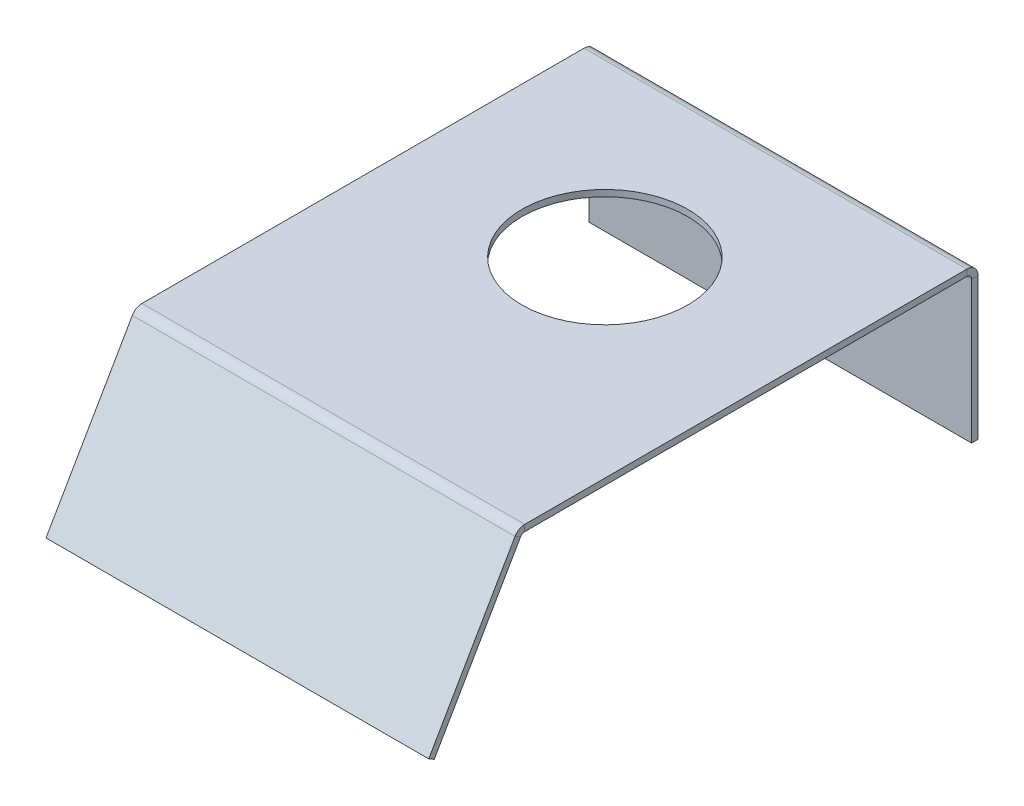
ISO-10303-21;
HEADER;
FILE_DESCRIPTION(('STEP AP214'),'2;1');
FILE_NAME('part.step','',(''),(''),'','','');
FILE_SCHEMA(('AUTOMOTIVE_DESIGN { 1 0 10303 214 1 1 1 1 }'));
ENDSEC;
DATA;
#1=APPLICATION_CONTEXT('core data for automotive mechanical design processes');
#2=APPLICATION_PROTOCOL_DEFINITION('international standard','automotive_design',2000,#1);
#3=PRODUCT_CONTEXT('',#1,'mechanical');
#4=PRODUCT('Part','Part','',(#3));
#5=PRODUCT_RELATED_PRODUCT_CATEGORY('part','',(#4));
#6=PRODUCT_DEFINITION_FORMATION('','',#4);
#7=PRODUCT_DEFINITION_CONTEXT('part definition',#1,'design');
#8=PRODUCT_DEFINITION('design','',#6,#7);
#9=PRODUCT_DEFINITION_SHAPE('','',#8);
#10=(LENGTH_UNIT() NAMED_UNIT(*) SI_UNIT(.MILLI.,.METRE.));
#11=(NAMED_UNIT(*) PLANE_ANGLE_UNIT() SI_UNIT($,.RADIAN.));
#12=(NAMED_UNIT(*) SI_UNIT($,.STERADIAN.) SOLID_ANGLE_UNIT());
#13=UNCERTAINTY_MEASURE_WITH_UNIT(LENGTH_MEASURE(1.E-05),#10,'distance_accuracy_value','');
#14=(GEOMETRIC_REPRESENTATION_CONTEXT(3) GLOBAL_UNCERTAINTY_ASSIGNED_CONTEXT((#13)) GLOBAL_UNIT_ASSIGNED_CONTEXT((#10,
#11,#12)) REPRESENTATION_CONTEXT('',''));
#15=CARTESIAN_POINT('',(0.,0.,0.));
#16=DIRECTION('',(0.,0.,1.));
#17=DIRECTION('',(1.,0.,0.));
#18=AXIS2_PLACEMENT_3D('',#15,#16,#17);
#19=CARTESIAN_POINT('',(60.,0.,-53.5));
#20=DIRECTION('',(1.,0.,0.));
#21=DIRECTION('',(0.,0.,-1.));
#22=AXIS2_PLACEMENT_3D('',#19,#20,#21);
#23=PLANE('',#22);
#24=DIRECTION('',(0.,1.,0.));
#25=VECTOR('',#24,1.);
#26=CARTESIAN_POINT('',(60.,0.,-53.5));
#27=LINE('',#26,#25);
#28=CARTESIAN_POINT('',(60.,0.,-53.5));
#29=VERTEX_POINT('',#28);
#30=CARTESIAN_POINT('',(60.,2.,-53.5));
#31=VERTEX_POINT('',#30);
#32=EDGE_CURVE('E11',#29,#31,#27,.T.);
#33=ORIENTED_EDGE('',*,*,#32,.F.);
#34=CARTESIAN_POINT('',(60.,-1.5,-53.5));
#35=DIRECTION('',(-1.,0.,0.));
#36=DIRECTION('',(0.,0.,1.));
#37=AXIS2_PLACEMENT_3D('',#34,#35,#36);
#38=CIRCLE('',#37,1.5);
#39=CARTESIAN_POINT('',(60.,-1.5,-55.));
#40=VERTEX_POINT('',#39);
#41=EDGE_CURVE('E245',#40,#29,#38,.F.);
#42=ORIENTED_EDGE('',*,*,#41,.F.);
#43=DIRECTION('',(0.,0.,1.));
#44=VECTOR('',#43,1.);
#45=CARTESIAN_POINT('',(60.,-1.5,-57.));
#46=LINE('',#45,#44);
#47=CARTESIAN_POINT('',(60.,-1.5,-57.));
#48=VERTEX_POINT('',#47);
#49=EDGE_CURVE('E42',#48,#40,#46,.T.);
#50=ORIENTED_EDGE('',*,*,#49,.F.);
#51=CARTESIAN_POINT('',(60.,-1.5,-53.5));
#52=DIRECTION('',(1.,0.,0.));
#53=DIRECTION('',(0.,0.,-1.));
#54=AXIS2_PLACEMENT_3D('',#51,#52,#53);
#55=CIRCLE('',#54,3.5);
#56=EDGE_CURVE('E142',#48,#31,#55,.T.);
#57=ORIENTED_EDGE('',*,*,#56,.T.);
#58=EDGE_LOOP('',(#33,#42,#50,#57));
#59=FACE_BOUND('',#58,.T.);
#60=ADVANCED_FACE('F34',(#59),#23,.T.);
#61=CARTESIAN_POINT('',(60.,-1.5,-57.));
#62=DIRECTION('',(1.,0.,0.));
#63=DIRECTION('',(0.,0.,-1.));
#64=AXIS2_PLACEMENT_3D('',#61,#62,#63);
#65=PLANE('',#64);
#66=DIRECTION('',(0.,0.,1.));
#67=VECTOR('',#66,1.);
#68=CARTESIAN_POINT('',(60.,0.,0.));
#69=LINE('',#68,#67);
#70=CARTESIAN_POINT('',(60.,0.,85.1339745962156));
#71=VERTEX_POINT('',#70);
#72=EDGE_CURVE('E137',#29,#71,#69,.T.);
#73=ORIENTED_EDGE('',*,*,#72,.F.);
#74=ORIENTED_EDGE('',*,*,#32,.T.);
#75=DIRECTION('',(0.,0.,1.));
#76=VECTOR('',#75,1.);
#77=CARTESIAN_POINT('',(60.,2.,-55.));
#78=LINE('',#77,#76);
#79=CARTESIAN_POINT('',(60.,1.99999999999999,85.1339745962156));
#80=VERTEX_POINT('',#79);
#81=EDGE_CURVE('E134',#31,#80,#78,.T.);
#82=ORIENTED_EDGE('',*,*,#81,.T.);
#83=DIRECTION('',(0.,-1.,0.));
#84=VECTOR('',#83,1.);
#85=CARTESIAN_POINT('',(60.,1.99999999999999,85.1339745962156));
#86=LINE('',#85,#84);
#87=EDGE_CURVE('E225',#80,#71,#86,.T.);
#88=ORIENTED_EDGE('',*,*,#87,.T.);
#89=EDGE_LOOP('',(#73,#74,#82,#88));
#90=FACE_BOUND('',#89,.T.);
#91=ADVANCED_FACE('F132',(#90),#65,.T.);
#92=CARTESIAN_POINT('',(-60.,-1.5,-55.));
#93=DIRECTION('',(-1.,0.,0.));
#94=DIRECTION('',(0.,0.,1.));
#95=AXIS2_PLACEMENT_3D('',#92,#93,#94);
#96=PLANE('',#95);
#97=DIRECTION('',(0.,0.,-1.));
#98=VECTOR('',#97,1.);
#99=CARTESIAN_POINT('',(-60.,-1.5,-55.));
#100=LINE('',#99,#98);
#101=CARTESIAN_POINT('',(-60.,-1.5,-55.));
#102=VERTEX_POINT('',#101);
#103=CARTESIAN_POINT('',(-60.,-1.5,-57.));
#104=VERTEX_POINT('',#103);
#105=EDGE_CURVE('E230',#102,#104,#100,.T.);
#106=ORIENTED_EDGE('',*,*,#105,.F.);
#107=CARTESIAN_POINT('',(-60.,-1.5,-53.5));
#108=DIRECTION('',(-1.,0.,0.));
#109=DIRECTION('',(0.,0.,1.));
#110=AXIS2_PLACEMENT_3D('',#107,#108,#109);
#111=CIRCLE('',#110,1.5);
#112=CARTESIAN_POINT('',(-60.,0.,-53.5));
#113=VERTEX_POINT('',#112);
#114=EDGE_CURVE('E182',#102,#113,#111,.F.);
#115=ORIENTED_EDGE('',*,*,#114,.T.);
#116=DIRECTION('',(0.,-1.,0.));
#117=VECTOR('',#116,1.);
#118=CARTESIAN_POINT('',(-60.,2.,-53.5));
#119=LINE('',#118,#117);
#120=CARTESIAN_POINT('',(-60.,2.,-53.5));
#121=VERTEX_POINT('',#120);
#122=EDGE_CURVE('E228',#121,#113,#119,.T.);
#123=ORIENTED_EDGE('',*,*,#122,.F.);
#124=CARTESIAN_POINT('',(-60.,-1.5,-53.5));
#125=DIRECTION('',(1.,0.,0.));
#126=DIRECTION('',(0.,0.,-1.));
#127=AXIS2_PLACEMENT_3D('',#124,#125,#126);
#128=CIRCLE('',#127,3.5);
#129=EDGE_CURVE('E154',#104,#121,#128,.T.);
#130=ORIENTED_EDGE('',*,*,#129,.F.);
#131=EDGE_LOOP('',(#106,#115,#123,#130));
#132=FACE_BOUND('',#131,.T.);
#133=ADVANCED_FACE('F288',(#132),#96,.T.);
#134=CARTESIAN_POINT('',(-60.,2.,-53.5));
#135=DIRECTION('',(-1.,0.,0.));
#136=DIRECTION('',(0.,0.,1.));
#137=AXIS2_PLACEMENT_3D('',#134,#135,#136);
#138=PLANE('',#137);
#139=DIRECTION('',(0.,1.,0.));
#140=VECTOR('',#139,1.);
#141=CARTESIAN_POINT('',(-60.,-46.,-55.));
#142=LINE('',#141,#140);
#143=CARTESIAN_POINT('',(-60.,-46.,-55.));
#144=VERTEX_POINT('',#143);
#145=EDGE_CURVE('E185',#144,#102,#142,.T.);
#146=ORIENTED_EDGE('',*,*,#145,.T.);
#147=ORIENTED_EDGE('',*,*,#105,.T.);
#148=DIRECTION('',(0.,1.,0.));
#149=VECTOR('',#148,1.);
#150=CARTESIAN_POINT('',(-60.,-46.,-57.));
#151=LINE('',#150,#149);
#152=CARTESIAN_POINT('',(-60.,-46.,-57.));
#153=VERTEX_POINT('',#152);
#154=EDGE_CURVE('E191',#153,#104,#151,.T.);
#155=ORIENTED_EDGE('',*,*,#154,.F.);
#156=DIRECTION('',(0.,0.,1.));
#157=VECTOR('',#156,1.);
#158=CARTESIAN_POINT('',(-60.,-46.,-57.));
#159=LINE('',#158,#157);
#160=EDGE_CURVE('E188',#153,#144,#159,.T.);
#161=ORIENTED_EDGE('',*,*,#160,.T.);
#162=EDGE_LOOP('',(#146,#147,#155,#161));
#163=FACE_BOUND('',#162,.T.);
#164=ADVANCED_FACE('F292',(#163),#138,.T.);
#165=CARTESIAN_POINT('',(60.,-0.750000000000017,86.4330127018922));
#166=DIRECTION('',(1.,0.,0.));
#167=DIRECTION('',(0.,0.,-1.));
#168=AXIS2_PLACEMENT_3D('',#165,#166,#167);
#169=PLANE('',#168);
#170=DIRECTION('',(0.,0.499999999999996,0.866025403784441));
#171=VECTOR('',#170,1.);
#172=CARTESIAN_POINT('',(60.,-0.750000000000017,86.4330127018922));
#173=LINE('',#172,#171);
#174=CARTESIAN_POINT('',(60.,-0.750000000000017,86.4330127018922));
#175=VERTEX_POINT('',#174);
#176=CARTESIAN_POINT('',(60.,0.249999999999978,88.1650635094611));
#177=VERTEX_POINT('',#176);
#178=EDGE_CURVE('E50',#175,#177,#173,.T.);
#179=ORIENTED_EDGE('',*,*,#178,.F.);
#180=CARTESIAN_POINT('',(60.,-1.50000000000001,85.1339745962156));
#181=DIRECTION('',(-1.,0.,0.));
#182=DIRECTION('',(0.,0.,1.));
#183=AXIS2_PLACEMENT_3D('',#180,#181,#182);
#184=CIRCLE('',#183,1.5);
#185=EDGE_CURVE('E255',#71,#175,#184,.F.);
#186=ORIENTED_EDGE('',*,*,#185,.F.);
#187=ORIENTED_EDGE('',*,*,#87,.F.);
#188=CARTESIAN_POINT('',(60.,-1.50000000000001,85.1339745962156));
#189=DIRECTION('',(1.,0.,0.));
#190=DIRECTION('',(0.,0.,-1.));
#191=AXIS2_PLACEMENT_3D('',#188,#189,#190);
#192=CIRCLE('',#191,3.5);
#193=EDGE_CURVE('E162',#80,#177,#192,.T.);
#194=ORIENTED_EDGE('',*,*,#193,.T.);
#195=EDGE_LOOP('',(#179,#186,#187,#194));
#196=FACE_BOUND('',#195,.T.);
#197=ADVANCED_FACE('F298',(#196),#169,.T.);
#198=CARTESIAN_POINT('',(60.,1.99999999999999,85.1339745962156));
#199=DIRECTION('',(1.,0.,0.));
#200=DIRECTION('',(0.,0.,-1.));
#201=AXIS2_PLACEMENT_3D('',#198,#199,#200);
#202=PLANE('',#201);
#203=DIRECTION('',(0.,-0.86602540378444,0.499999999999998));
#204=VECTOR('',#203,1.);
#205=CARTESIAN_POINT('',(60.,0.,86.));
#206=LINE('',#205,#204);
#207=CARTESIAN_POINT('',(60.,-47.6313972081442,113.5));
#208=VERTEX_POINT('',#207);
#209=EDGE_CURVE('E258',#175,#208,#206,.T.);
#210=ORIENTED_EDGE('',*,*,#209,.F.);
#211=ORIENTED_EDGE('',*,*,#178,.T.);
#212=DIRECTION('',(0.,-0.86602540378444,0.499999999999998));
#213=VECTOR('',#212,1.);
#214=CARTESIAN_POINT('',(60.,0.999999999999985,87.7320508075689));
#215=LINE('',#214,#213);
#216=CARTESIAN_POINT('',(60.,-46.6313972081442,115.232050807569));
#217=VERTEX_POINT('',#216);
#218=EDGE_CURVE('E104',#177,#217,#215,.T.);
#219=ORIENTED_EDGE('',*,*,#218,.T.);
#220=DIRECTION('',(0.,0.499999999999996,0.866025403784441));
#221=VECTOR('',#220,1.);
#222=CARTESIAN_POINT('',(60.,-47.6313972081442,113.5));
#223=LINE('',#222,#221);
#224=EDGE_CURVE('E261',#208,#217,#223,.T.);
#225=ORIENTED_EDGE('',*,*,#224,.F.);
#226=EDGE_LOOP('',(#210,#211,#219,#225));
#227=FACE_BOUND('',#226,.T.);
#228=ADVANCED_FACE('F302',(#227),#202,.T.);
#229=CARTESIAN_POINT('',(-60.,0.,85.1339745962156));
#230=DIRECTION('',(-1.,0.,0.));
#231=DIRECTION('',(0.,0.,1.));
#232=AXIS2_PLACEMENT_3D('',#229,#230,#231);
#233=PLANE('',#232);
#234=DIRECTION('',(0.,1.,0.));
#235=VECTOR('',#234,1.);
#236=CARTESIAN_POINT('',(-60.,0.,85.1339745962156));
#237=LINE('',#236,#235);
#238=CARTESIAN_POINT('',(-60.,0.,85.1339745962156));
#239=VERTEX_POINT('',#238);
#240=CARTESIAN_POINT('',(-60.,1.99999999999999,85.1339745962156));
#241=VERTEX_POINT('',#240);
#242=EDGE_CURVE('E91',#239,#241,#237,.T.);
#243=ORIENTED_EDGE('',*,*,#242,.F.);
#244=CARTESIAN_POINT('',(-60.,-1.50000000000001,85.1339745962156));
#245=DIRECTION('',(-1.,0.,0.));
#246=DIRECTION('',(0.,0.,1.));
#247=AXIS2_PLACEMENT_3D('',#244,#245,#246);
#248=CIRCLE('',#247,1.5);
#249=CARTESIAN_POINT('',(-60.,-0.750000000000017,86.4330127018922));
#250=VERTEX_POINT('',#249);
#251=EDGE_CURVE('E178',#239,#250,#248,.F.);
#252=ORIENTED_EDGE('',*,*,#251,.T.);
#253=DIRECTION('',(0.,-0.499999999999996,-0.866025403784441));
#254=VECTOR('',#253,1.);
#255=CARTESIAN_POINT('',(-60.,0.249999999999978,88.1650635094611));
#256=LINE('',#255,#254);
#257=CARTESIAN_POINT('',(-60.,0.249999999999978,88.1650635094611));
#258=VERTEX_POINT('',#257);
#259=EDGE_CURVE('E98',#258,#250,#256,.T.);
#260=ORIENTED_EDGE('',*,*,#259,.F.);
#261=CARTESIAN_POINT('',(-60.,-1.50000000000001,85.1339745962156));
#262=DIRECTION('',(1.,0.,0.));
#263=DIRECTION('',(0.,0.,-1.));
#264=AXIS2_PLACEMENT_3D('',#261,#262,#263);
#265=CIRCLE('',#264,3.5);
#266=EDGE_CURVE('E197',#241,#258,#265,.T.);
#267=ORIENTED_EDGE('',*,*,#266,.F.);
#268=EDGE_LOOP('',(#243,#252,#260,#267));
#269=FACE_BOUND('',#268,.T.);
#270=ADVANCED_FACE('F306',(#269),#233,.T.);
#271=CARTESIAN_POINT('',(-60.,0.249999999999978,88.1650635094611));
#272=DIRECTION('',(-1.,0.,0.));
#273=DIRECTION('',(0.,0.,1.));
#274=AXIS2_PLACEMENT_3D('',#271,#272,#273);
#275=PLANE('',#274);
#276=DIRECTION('',(0.,0.,1.));
#277=VECTOR('',#276,1.);
#278=CARTESIAN_POINT('',(-60.,0.,-55.));
#279=LINE('',#278,#277);
#280=EDGE_CURVE('E180',#113,#239,#279,.T.);
#281=ORIENTED_EDGE('',*,*,#280,.T.);
#282=ORIENTED_EDGE('',*,*,#242,.T.);
#283=DIRECTION('',(0.,0.,1.));
#284=VECTOR('',#283,1.);
#285=CARTESIAN_POINT('',(-60.,2.,0.));
#286=LINE('',#285,#284);
#287=EDGE_CURVE('E195',#121,#241,#286,.T.);
#288=ORIENTED_EDGE('',*,*,#287,.F.);
#289=ORIENTED_EDGE('',*,*,#122,.T.);
#290=EDGE_LOOP('',(#281,#282,#288,#289));
#291=FACE_BOUND('',#290,.T.);
#292=ADVANCED_FACE('F309',(#291),#275,.T.);
#293=CARTESIAN_POINT('',(60.,0.999999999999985,87.7320508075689));
#294=DIRECTION('',(0.,-0.499999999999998,-0.86602540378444));
#295=DIRECTION('',(0.,0.86602540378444,-0.499999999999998));
#296=AXIS2_PLACEMENT_3D('',#293,#294,#295);
#297=PLANE('',#296);
#298=DIRECTION('',(0.,-0.86602540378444,0.499999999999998));
#299=VECTOR('',#298,1.);
#300=CARTESIAN_POINT('',(-60.,0.999999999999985,87.7320508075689));
#301=LINE('',#300,#299);
#302=CARTESIAN_POINT('',(-60.,-46.6313972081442,115.232050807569));
#303=VERTEX_POINT('',#302);
#304=EDGE_CURVE('E168',#258,#303,#301,.T.);
#305=ORIENTED_EDGE('',*,*,#304,.T.);
#306=DIRECTION('',(-1.,0.,0.));
#307=VECTOR('',#306,1.);
#308=CARTESIAN_POINT('',(60.,-46.6313972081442,115.232050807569));
#309=LINE('',#308,#307);
#310=EDGE_CURVE('E221',#217,#303,#309,.T.);
#311=ORIENTED_EDGE('',*,*,#310,.F.);
#312=ORIENTED_EDGE('',*,*,#218,.F.);
#313=DIRECTION('',(-1.,0.,0.));
#314=VECTOR('',#313,1.);
#315=CARTESIAN_POINT('',(60.,0.249999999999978,88.1650635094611));
#316=LINE('',#315,#314);
#317=EDGE_CURVE('E164',#177,#258,#316,.T.);
#318=ORIENTED_EDGE('',*,*,#317,.T.);
#319=EDGE_LOOP('',(#305,#311,#312,#318));
#320=FACE_BOUND('',#319,.T.);
#321=ADVANCED_FACE('F312',(#320),#297,.F.);
#322=CARTESIAN_POINT('',(60.,-47.6313972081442,113.5));
#323=DIRECTION('',(0.,-0.866025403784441,0.499999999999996));
#324=DIRECTION('',(0.,-0.499999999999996,-0.866025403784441));
#325=AXIS2_PLACEMENT_3D('',#322,#323,#324);
#326=PLANE('',#325);
#327=DIRECTION('',(0.,0.499999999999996,0.866025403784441));
#328=VECTOR('',#327,1.);
#329=CARTESIAN_POINT('',(-60.,-47.6313972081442,113.5));
#330=LINE('',#329,#328);
#331=CARTESIAN_POINT('',(-60.,-47.6313972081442,113.5));
#332=VERTEX_POINT('',#331);
#333=EDGE_CURVE('E171',#332,#303,#330,.T.);
#334=ORIENTED_EDGE('',*,*,#333,.F.);
#335=DIRECTION('',(-1.,0.,0.));
#336=VECTOR('',#335,1.);
#337=CARTESIAN_POINT('',(60.,-47.6313972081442,113.5));
#338=LINE('',#337,#336);
#339=EDGE_CURVE('E219',#208,#332,#338,.T.);
#340=ORIENTED_EDGE('',*,*,#339,.F.);
#341=ORIENTED_EDGE('',*,*,#224,.T.);
#342=ORIENTED_EDGE('',*,*,#310,.T.);
#343=EDGE_LOOP('',(#334,#340,#341,#342));
#344=FACE_BOUND('',#343,.T.);
#345=ADVANCED_FACE('F315',(#344),#326,.T.);
#346=CARTESIAN_POINT('',(60.,0.,86.));
#347=DIRECTION('',(0.,-0.499999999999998,-0.86602540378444));
#348=DIRECTION('',(0.,0.86602540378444,-0.499999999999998));
#349=AXIS2_PLACEMENT_3D('',#346,#347,#348);
#350=PLANE('',#349);
#351=DIRECTION('',(0.,-0.86602540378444,0.499999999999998));
#352=VECTOR('',#351,1.);
#353=CARTESIAN_POINT('',(-60.,0.,86.));
#354=LINE('',#353,#352);
#355=EDGE_CURVE('E175',#250,#332,#354,.T.);
#356=ORIENTED_EDGE('',*,*,#355,.F.);
#357=DIRECTION('',(-1.,0.,0.));
#358=VECTOR('',#357,1.);
#359=CARTESIAN_POINT('',(60.,-0.750000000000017,86.4330127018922));
#360=LINE('',#359,#358);
#361=EDGE_CURVE('E216',#175,#250,#360,.T.);
#362=ORIENTED_EDGE('',*,*,#361,.F.);
#363=ORIENTED_EDGE('',*,*,#209,.T.);
#364=ORIENTED_EDGE('',*,*,#339,.T.);
#365=EDGE_LOOP('',(#356,#362,#363,#364));
#366=FACE_BOUND('',#365,.T.);
#367=ADVANCED_FACE('F319',(#366),#350,.T.);
#368=CARTESIAN_POINT('',(60.,-1.50000000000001,85.1339745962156));
#369=DIRECTION('',(-1.,0.,0.));
#370=DIRECTION('',(0.,0.,1.));
#371=AXIS2_PLACEMENT_3D('',#368,#369,#370);
#372=CYLINDRICAL_SURFACE('',#371,1.5);
#373=ORIENTED_EDGE('',*,*,#251,.F.);
#374=DIRECTION('',(-1.,0.,0.));
#375=VECTOR('',#374,1.);
#376=CARTESIAN_POINT('',(60.,0.,85.1339745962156));
#377=LINE('',#376,#375);
#378=EDGE_CURVE('E213',#71,#239,#377,.T.);
#379=ORIENTED_EDGE('',*,*,#378,.F.);
#380=ORIENTED_EDGE('',*,*,#185,.T.);
#381=ORIENTED_EDGE('',*,*,#361,.T.);
#382=EDGE_LOOP('',(#373,#379,#380,#381));
#383=FACE_BOUND('',#382,.T.);
#384=ADVANCED_FACE('F323',(#383),#372,.F.);
#385=CARTESIAN_POINT('',(60.,0.,-55.));
#386=DIRECTION('',(0.,-1.,0.));
#387=DIRECTION('',(0.,0.,-1.));
#388=AXIS2_PLACEMENT_3D('',#385,#386,#387);
#389=PLANE('',#388);
#390=CARTESIAN_POINT('',(0.,0.,0.));
#391=DIRECTION('',(0.,-1.,0.));
#392=DIRECTION('',(0.,0.,-1.));
#393=AXIS2_PLACEMENT_3D('',#390,#391,#392);
#394=CIRCLE('',#393,26.);
#395=CARTESIAN_POINT('',(0.,0.,-26.));
#396=VERTEX_POINT('',#395);
#397=EDGE_CURVE('E172',#396,#396,#394,.T.);
#398=ORIENTED_EDGE('',*,*,#397,.F.);
#399=EDGE_LOOP('',(#398));
#400=FACE_BOUND('',#399,.T.);
#401=ORIENTED_EDGE('',*,*,#280,.F.);
#402=DIRECTION('',(-1.,0.,0.));
#403=VECTOR('',#402,1.);
#404=CARTESIAN_POINT('',(60.,0.,-53.5));
#405=LINE('',#404,#403);
#406=EDGE_CURVE('E210',#29,#113,#405,.T.);
#407=ORIENTED_EDGE('',*,*,#406,.F.);
#408=ORIENTED_EDGE('',*,*,#72,.T.);
#409=ORIENTED_EDGE('',*,*,#378,.T.);
#410=EDGE_LOOP('',(#401,#407,#408,#409));
#411=FACE_BOUND('',#410,.T.);
#412=ADVANCED_FACE('F327',(#400,#411),#389,.T.);
#413=CARTESIAN_POINT('',(60.,-1.5,-53.5));
#414=DIRECTION('',(-1.,0.,0.));
#415=DIRECTION('',(0.,0.,1.));
#416=AXIS2_PLACEMENT_3D('',#413,#414,#415);
#417=CYLINDRICAL_SURFACE('',#416,1.5);
#418=ORIENTED_EDGE('',*,*,#114,.F.);
#419=DIRECTION('',(-1.,0.,0.));
#420=VECTOR('',#419,1.);
#421=CARTESIAN_POINT('',(60.,-1.5,-55.));
#422=LINE('',#421,#420);
#423=EDGE_CURVE('E207',#40,#102,#422,.T.);
#424=ORIENTED_EDGE('',*,*,#423,.F.);
#425=ORIENTED_EDGE('',*,*,#41,.T.);
#426=ORIENTED_EDGE('',*,*,#406,.T.);
#427=EDGE_LOOP('',(#418,#424,#425,#426));
#428=FACE_BOUND('',#427,.T.);
#429=ADVANCED_FACE('F244',(#428),#417,.F.);
#430=CARTESIAN_POINT('',(60.,-46.,-55.));
#431=DIRECTION('',(0.,0.,1.));
#432=DIRECTION('',(1.,0.,0.));
#433=AXIS2_PLACEMENT_3D('',#430,#431,#432);
#434=PLANE('',#433);
#435=ORIENTED_EDGE('',*,*,#145,.F.);
#436=DIRECTION('',(-1.,0.,0.));
#437=VECTOR('',#436,1.);
#438=CARTESIAN_POINT('',(60.,-46.,-55.));
#439=LINE('',#438,#437);
#440=CARTESIAN_POINT('',(60.,-46.,-55.));
#441=VERTEX_POINT('',#440);
#442=EDGE_CURVE('E205',#441,#144,#439,.T.);
#443=ORIENTED_EDGE('',*,*,#442,.F.);
#444=DIRECTION('',(0.,1.,0.));
#445=VECTOR('',#444,1.);
#446=CARTESIAN_POINT('',(60.,-46.,-55.));
#447=LINE('',#446,#445);
#448=EDGE_CURVE('E237',#441,#40,#447,.T.);
#449=ORIENTED_EDGE('',*,*,#448,.T.);
#450=ORIENTED_EDGE('',*,*,#423,.T.);
#451=EDGE_LOOP('',(#435,#443,#449,#450));
#452=FACE_BOUND('',#451,.T.);
#453=ADVANCED_FACE('F249',(#452),#434,.T.);
#454=CARTESIAN_POINT('',(60.,-46.,-57.));
#455=DIRECTION('',(0.,-1.,0.));
#456=DIRECTION('',(0.,0.,-1.));
#457=AXIS2_PLACEMENT_3D('',#454,#455,#456);
#458=PLANE('',#457);
#459=ORIENTED_EDGE('',*,*,#160,.F.);
#460=DIRECTION('',(-1.,0.,0.));
#461=VECTOR('',#460,1.);
#462=CARTESIAN_POINT('',(60.,-46.,-57.));
#463=LINE('',#462,#461);
#464=CARTESIAN_POINT('',(60.,-46.,-57.));
#465=VERTEX_POINT('',#464);
#466=EDGE_CURVE('E203',#465,#153,#463,.T.);
#467=ORIENTED_EDGE('',*,*,#466,.F.);
#468=DIRECTION('',(0.,0.,1.));
#469=VECTOR('',#468,1.);
#470=CARTESIAN_POINT('',(60.,-46.,-57.));
#471=LINE('',#470,#469);
#472=EDGE_CURVE('E250',#465,#441,#471,.T.);
#473=ORIENTED_EDGE('',*,*,#472,.T.);
#474=ORIENTED_EDGE('',*,*,#442,.T.);
#475=EDGE_LOOP('',(#459,#467,#473,#474));
#476=FACE_BOUND('',#475,.T.);
#477=ADVANCED_FACE('F336',(#476),#458,.T.);
#478=CARTESIAN_POINT('',(60.,-46.,-57.));
#479=DIRECTION('',(0.,0.,1.));
#480=DIRECTION('',(1.,0.,0.));
#481=AXIS2_PLACEMENT_3D('',#478,#479,#480);
#482=PLANE('',#481);
#483=ORIENTED_EDGE('',*,*,#154,.T.);
#484=DIRECTION('',(-1.,0.,0.));
#485=VECTOR('',#484,1.);
#486=CARTESIAN_POINT('',(60.,-1.5,-57.));
#487=LINE('',#486,#485);
#488=EDGE_CURVE('E156',#48,#104,#487,.T.);
#489=ORIENTED_EDGE('',*,*,#488,.F.);
#490=DIRECTION('',(0.,1.,0.));
#491=VECTOR('',#490,1.);
#492=CARTESIAN_POINT('',(60.,-46.,-57.));
#493=LINE('',#492,#491);
#494=EDGE_CURVE('E147',#465,#48,#493,.T.);
#495=ORIENTED_EDGE('',*,*,#494,.F.);
#496=ORIENTED_EDGE('',*,*,#466,.T.);
#497=EDGE_LOOP('',(#483,#489,#495,#496));
#498=FACE_BOUND('',#497,.T.);
#499=ADVANCED_FACE('F282',(#498),#482,.F.);
#500=CARTESIAN_POINT('',(60.,-1.5,-53.5));
#501=DIRECTION('',(-1.,0.,0.));
#502=DIRECTION('',(0.,0.,1.));
#503=AXIS2_PLACEMENT_3D('',#500,#501,#502);
#504=CYLINDRICAL_SURFACE('',#503,3.5);
#505=ORIENTED_EDGE('',*,*,#129,.T.);
#506=DIRECTION('',(-1.,0.,0.));
#507=VECTOR('',#506,1.);
#508=CARTESIAN_POINT('',(60.,2.,-53.5));
#509=LINE('',#508,#507);
#510=EDGE_CURVE('E151',#31,#121,#509,.T.);
#511=ORIENTED_EDGE('',*,*,#510,.F.);
#512=ORIENTED_EDGE('',*,*,#56,.F.);
#513=ORIENTED_EDGE('',*,*,#488,.T.);
#514=EDGE_LOOP('',(#505,#511,#512,#513));
#515=FACE_BOUND('',#514,.T.);
#516=ADVANCED_FACE('F152',(#515),#504,.T.);
#517=CARTESIAN_POINT('',(60.,2.,0.));
#518=DIRECTION('',(0.,-1.,0.));
#519=DIRECTION('',(0.,0.,-1.));
#520=AXIS2_PLACEMENT_3D('',#517,#518,#519);
#521=PLANE('',#520);
#522=CARTESIAN_POINT('',(0.,2.,0.));
#523=DIRECTION('',(0.,1.,0.));
#524=DIRECTION('',(0.,0.,1.));
#525=AXIS2_PLACEMENT_3D('',#522,#523,#524);
#526=CIRCLE('',#525,26.);
#527=CARTESIAN_POINT('',(0.,2.,26.));
#528=VERTEX_POINT('',#527);
#529=EDGE_CURVE('E267',#528,#528,#526,.T.);
#530=ORIENTED_EDGE('',*,*,#529,.F.);
#531=EDGE_LOOP('',(#530));
#532=FACE_BOUND('',#531,.T.);
#533=ORIENTED_EDGE('',*,*,#287,.T.);
#534=DIRECTION('',(-1.,0.,0.));
#535=VECTOR('',#534,1.);
#536=CARTESIAN_POINT('',(60.,1.99999999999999,85.1339745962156));
#537=LINE('',#536,#535);
#538=EDGE_CURVE('E157',#80,#241,#537,.T.);
#539=ORIENTED_EDGE('',*,*,#538,.F.);
#540=ORIENTED_EDGE('',*,*,#81,.F.);
#541=ORIENTED_EDGE('',*,*,#510,.T.);
#542=EDGE_LOOP('',(#533,#539,#540,#541));
#543=FACE_BOUND('',#542,.T.);
#544=ADVANCED_FACE('F159',(#532,#543),#521,.F.);
#545=CARTESIAN_POINT('',(60.,-1.50000000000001,85.1339745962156));
#546=DIRECTION('',(-1.,0.,0.));
#547=DIRECTION('',(0.,0.,1.));
#548=AXIS2_PLACEMENT_3D('',#545,#546,#547);
#549=CYLINDRICAL_SURFACE('',#548,3.5);
#550=ORIENTED_EDGE('',*,*,#266,.T.);
#551=ORIENTED_EDGE('',*,*,#317,.F.);
#552=ORIENTED_EDGE('',*,*,#193,.F.);
#553=ORIENTED_EDGE('',*,*,#538,.T.);
#554=EDGE_LOOP('',(#550,#551,#552,#553));
#555=FACE_BOUND('',#554,.T.);
#556=ADVANCED_FACE('F274',(#555),#549,.T.);
#557=CARTESIAN_POINT('',(60.,-1.50000000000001,85.1339745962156));
#558=DIRECTION('',(-1.,0.,0.));
#559=DIRECTION('',(0.,0.,1.));
#560=AXIS2_PLACEMENT_3D('',#557,#558,#559);
#561=PLANE('',#560);
#562=ORIENTED_EDGE('',*,*,#494,.T.);
#563=ORIENTED_EDGE('',*,*,#49,.T.);
#564=ORIENTED_EDGE('',*,*,#448,.F.);
#565=ORIENTED_EDGE('',*,*,#472,.F.);
#566=EDGE_LOOP('',(#562,#563,#564,#565));
#567=FACE_BOUND('',#566,.T.);
#568=ADVANCED_FACE('F234',(#567),#561,.F.);
#569=CARTESIAN_POINT('',(-60.,-1.50000000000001,85.1339745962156));
#570=DIRECTION('',(-1.,0.,0.));
#571=DIRECTION('',(0.,0.,1.));
#572=AXIS2_PLACEMENT_3D('',#569,#570,#571);
#573=PLANE('',#572);
#574=ORIENTED_EDGE('',*,*,#304,.F.);
#575=ORIENTED_EDGE('',*,*,#259,.T.);
#576=ORIENTED_EDGE('',*,*,#355,.T.);
#577=ORIENTED_EDGE('',*,*,#333,.T.);
#578=EDGE_LOOP('',(#574,#575,#576,#577));
#579=FACE_BOUND('',#578,.T.);
#580=ADVANCED_FACE('F357',(#579),#573,.T.);
#581=CARTESIAN_POINT('',(0.,-47.6313972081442,0.));
#582=DIRECTION('',(0.,1.,0.));
#583=DIRECTION('',(0.,0.,1.));
#584=AXIS2_PLACEMENT_3D('',#581,#582,#583);
#585=CYLINDRICAL_SURFACE('',#584,26.);
#586=ORIENTED_EDGE('',*,*,#397,.T.);
#587=EDGE_LOOP('',(#586));
#588=FACE_BOUND('',#587,.T.);
#589=ORIENTED_EDGE('',*,*,#529,.T.);
#590=EDGE_LOOP('',(#589));
#591=FACE_BOUND('',#590,.T.);
#592=ADVANCED_FACE('F271',(#588,#591),#585,.F.);
#593=CLOSED_SHELL('',(#60,#91,#133,#164,#197,#228,#270,#292,#321,#345,#367,#384,#412,#429,#453,
#477,#499,#516,#544,#556,#568,#580,#592));
#594=MANIFOLD_SOLID_BREP('B2',#593);
#595=ADVANCED_BREP_SHAPE_REPRESENTATION('',(#18,#594),#14);
#596=SHAPE_DEFINITION_REPRESENTATION(#9,#595);
ENDSEC;
END-ISO-10303-21;
